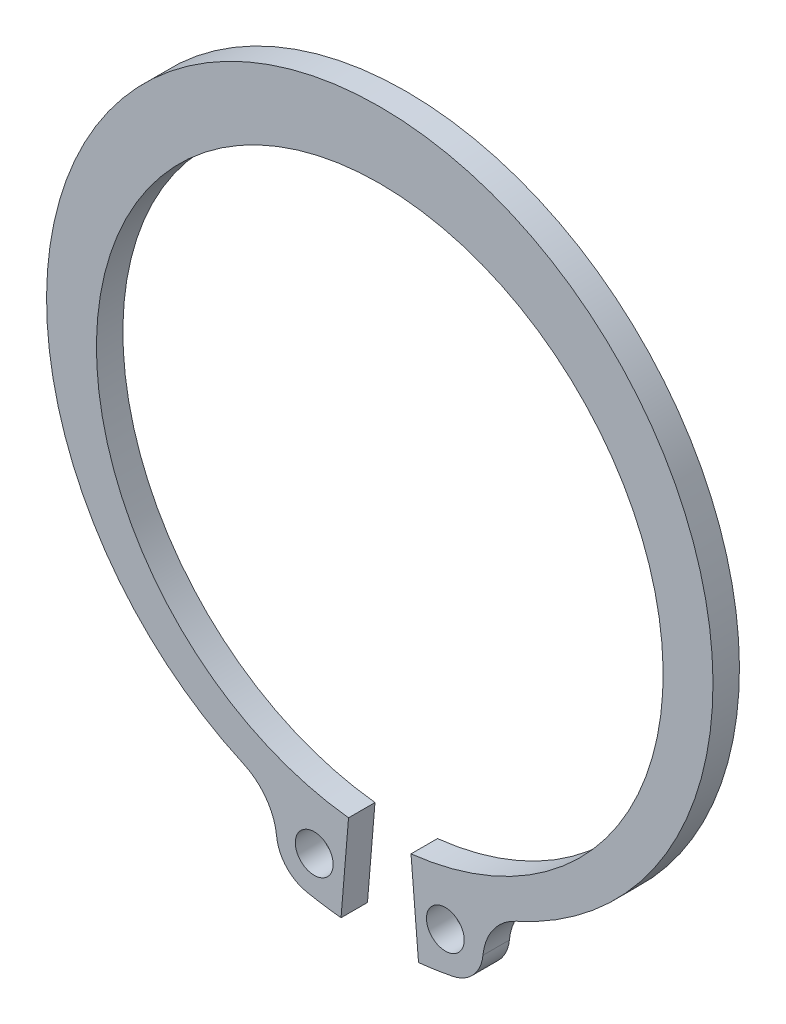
ISO-10303-21;
HEADER;
FILE_DESCRIPTION(('STEP AP214'),'2;1');
FILE_NAME('part.step','',(''),(''),'','','');
FILE_SCHEMA(('AUTOMOTIVE_DESIGN { 1 0 10303 214 1 1 1 1 }'));
ENDSEC;
DATA;
#1=APPLICATION_CONTEXT('core data for automotive mechanical design processes');
#2=APPLICATION_PROTOCOL_DEFINITION('international standard','automotive_design',2000,#1);
#3=PRODUCT_CONTEXT('',#1,'mechanical');
#4=PRODUCT('Part','Part','',(#3));
#5=PRODUCT_RELATED_PRODUCT_CATEGORY('part','',(#4));
#6=PRODUCT_DEFINITION_FORMATION('','',#4);
#7=PRODUCT_DEFINITION_CONTEXT('part definition',#1,'design');
#8=PRODUCT_DEFINITION('design','',#6,#7);
#9=PRODUCT_DEFINITION_SHAPE('','',#8);
#10=(LENGTH_UNIT() NAMED_UNIT(*) SI_UNIT(.MILLI.,.METRE.));
#11=(NAMED_UNIT(*) PLANE_ANGLE_UNIT() SI_UNIT($,.RADIAN.));
#12=(NAMED_UNIT(*) SI_UNIT($,.STERADIAN.) SOLID_ANGLE_UNIT());
#13=UNCERTAINTY_MEASURE_WITH_UNIT(LENGTH_MEASURE(1.E-05),#10,'distance_accuracy_value','');
#14=(GEOMETRIC_REPRESENTATION_CONTEXT(3) GLOBAL_UNCERTAINTY_ASSIGNED_CONTEXT((#13)) GLOBAL_UNIT_ASSIGNED_CONTEXT((#10,
#11,#12)) REPRESENTATION_CONTEXT('',''));
#15=CARTESIAN_POINT('',(0.,0.,0.));
#16=DIRECTION('',(0.,0.,1.));
#17=DIRECTION('',(1.,0.,0.));
#18=AXIS2_PLACEMENT_3D('',#15,#16,#17);
#19=CARTESIAN_POINT('',(1.1666015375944E-13,-2.22044604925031E-13,1.74999999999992));
#20=DIRECTION('',(0.,0.,1.));
#21=DIRECTION('',(1.,0.,0.));
#22=AXIS2_PLACEMENT_3D('',#19,#20,#21);
#23=PLANE('',#22);
#24=CARTESIAN_POINT('',(-4.33870801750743,-21.8211407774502,1.74999999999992));
#25=DIRECTION('',(0.,0.,1.));
#26=DIRECTION('',(-1.,0.,0.));
#27=AXIS2_PLACEMENT_3D('',#24,#25,#26);
#28=CIRCLE('',#27,1.25);
#29=CARTESIAN_POINT('',(-5.58870801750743,-21.8211407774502,1.74999999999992));
#30=VERTEX_POINT('',#29);
#31=EDGE_CURVE('E128',#30,#30,#28,.T.);
#32=ORIENTED_EDGE('',*,*,#31,.F.);
#33=EDGE_LOOP('',(#32));
#34=FACE_BOUND('',#33,.T.);
#35=CARTESIAN_POINT('',(1.1666015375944E-13,-2.22044604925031E-13,1.74999999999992));
#36=DIRECTION('',(0.,0.,-1.));
#37=DIRECTION('',(1.,0.,0.));
#38=AXIS2_PLACEMENT_3D('',#35,#36,#37);
#39=CIRCLE('',#38,18.75);
#40=CARTESIAN_POINT('',(-2.06665131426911,-18.6357573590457,1.74999999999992));
#41=VERTEX_POINT('',#40);
#42=CARTESIAN_POINT('',(2.0666513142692,-18.6357573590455,1.74999999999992));
#43=VERTEX_POINT('',#42);
#44=EDGE_CURVE('E150',#41,#43,#39,.T.);
#45=ORIENTED_EDGE('',*,*,#44,.T.);
#46=DIRECTION('',(0.0829496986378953,-0.996553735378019,0.));
#47=VECTOR('',#46,1.);
#48=CARTESIAN_POINT('',(2.0666513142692,-18.6357573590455,1.74999999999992));
#49=LINE('',#48,#47);
#50=CARTESIAN_POINT('',(2.56434950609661,-24.6150797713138,1.74999999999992));
#51=VERTEX_POINT('',#50);
#52=EDGE_CURVE('E123',#43,#51,#49,.T.);
#53=ORIENTED_EDGE('',*,*,#52,.T.);
#54=CARTESIAN_POINT('',(1.1666015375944E-13,-2.22044604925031E-13,1.74999999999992));
#55=DIRECTION('',(0.,0.,1.));
#56=DIRECTION('',(1.,0.,0.));
#57=AXIS2_PLACEMENT_3D('',#54,#55,#56);
#58=CIRCLE('',#57,24.7482936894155);
#59=CARTESIAN_POINT('',(4.82624068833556,-24.2731423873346,1.75000000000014));
#60=VERTEX_POINT('',#59);
#61=EDGE_CURVE('E153',#51,#60,#58,.T.);
#62=ORIENTED_EDGE('',*,*,#61,.T.);
#63=CARTESIAN_POINT('',(4.3387080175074,-21.8211407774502,1.74999999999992));
#64=DIRECTION('',(0.,0.,1.));
#65=DIRECTION('',(1.,0.,0.));
#66=AXIS2_PLACEMENT_3D('',#63,#64,#65);
#67=CIRCLE('',#66,2.5);
#68=CARTESIAN_POINT('',(6.8263893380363,-22.0690150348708,1.74999999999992));
#69=VERTEX_POINT('',#68);
#70=EDGE_CURVE('E155',#60,#69,#67,.T.);
#71=ORIENTED_EDGE('',*,*,#70,.T.);
#72=CARTESIAN_POINT('',(10.5579113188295,-22.4408264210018,1.74999999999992));
#73=DIRECTION('',(0.,0.,-1.));
#74=DIRECTION('',(1.,0.,0.));
#75=AXIS2_PLACEMENT_3D('',#72,#73,#74);
#76=CIRCLE('',#75,3.75);
#77=CARTESIAN_POINT('',(9.02333118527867,-19.0191946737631,1.74999999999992));
#78=VERTEX_POINT('',#77);
#79=EDGE_CURVE('E157',#69,#78,#76,.T.);
#80=ORIENTED_EDGE('',*,*,#79,.T.);
#81=CARTESIAN_POINT('',(0.,1.09999999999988,1.74999999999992));
#82=DIRECTION('',(0.,0.,1.));
#83=DIRECTION('',(1.,0.,0.));
#84=AXIS2_PLACEMENT_3D('',#81,#82,#83);
#85=CIRCLE('',#84,22.05);
#86=CARTESIAN_POINT('',(-9.02333118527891,-19.019194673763,1.74999999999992));
#87=VERTEX_POINT('',#86);
#88=EDGE_CURVE('E159',#78,#87,#85,.T.);
#89=ORIENTED_EDGE('',*,*,#88,.T.);
#90=CARTESIAN_POINT('',(-10.5579113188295,-22.4408264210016,1.74999999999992));
#91=DIRECTION('',(0.,0.,-1.));
#92=DIRECTION('',(-1.,0.,0.));
#93=AXIS2_PLACEMENT_3D('',#90,#91,#92);
#94=CIRCLE('',#93,3.75);
#95=CARTESIAN_POINT('',(-6.82638933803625,-22.0690150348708,1.74999999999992));
#96=VERTEX_POINT('',#95);
#97=EDGE_CURVE('E161',#87,#96,#94,.T.);
#98=ORIENTED_EDGE('',*,*,#97,.T.);
#99=CARTESIAN_POINT('',(-4.33870801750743,-21.8211407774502,1.74999999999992));
#100=DIRECTION('',(0.,0.,1.));
#101=DIRECTION('',(-1.,0.,0.));
#102=AXIS2_PLACEMENT_3D('',#99,#100,#101);
#103=CIRCLE('',#102,2.5);
#104=CARTESIAN_POINT('',(-4.82624068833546,-24.2731423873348,1.74999999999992));
#105=VERTEX_POINT('',#104);
#106=EDGE_CURVE('E163',#96,#105,#103,.T.);
#107=ORIENTED_EDGE('',*,*,#106,.T.);
#108=CARTESIAN_POINT('',(1.1666015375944E-13,-2.22044604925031E-13,1.74999999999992));
#109=DIRECTION('',(0.,0.,1.));
#110=DIRECTION('',(-1.,0.,0.));
#111=AXIS2_PLACEMENT_3D('',#108,#109,#110);
#112=CIRCLE('',#111,24.7482936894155);
#113=CARTESIAN_POINT('',(-2.56434950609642,-24.6150797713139,1.74999999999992));
#114=VERTEX_POINT('',#113);
#115=EDGE_CURVE('E52',#105,#114,#112,.T.);
#116=ORIENTED_EDGE('',*,*,#115,.T.);
#117=DIRECTION('',(0.0829496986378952,0.996553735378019,0.));
#118=VECTOR('',#117,1.);
#119=CARTESIAN_POINT('',(-2.06665131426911,-18.6357573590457,1.74999999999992));
#120=LINE('',#119,#118);
#121=EDGE_CURVE('E47',#114,#41,#120,.T.);
#122=ORIENTED_EDGE('',*,*,#121,.T.);
#123=EDGE_LOOP('',(#45,#53,#62,#71,#80,#89,#98,#107,#116,#122));
#124=FACE_BOUND('',#123,.T.);
#125=CARTESIAN_POINT('',(4.3387080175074,-21.8211407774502,1.74999999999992));
#126=DIRECTION('',(0.,0.,1.));
#127=DIRECTION('',(1.,0.,0.));
#128=AXIS2_PLACEMENT_3D('',#125,#126,#127);
#129=CIRCLE('',#128,1.25);
#130=CARTESIAN_POINT('',(3.0887080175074,-21.8211407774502,1.74999999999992));
#131=VERTEX_POINT('',#130);
#132=EDGE_CURVE('E250',#131,#131,#129,.T.);
#133=ORIENTED_EDGE('',*,*,#132,.F.);
#134=EDGE_LOOP('',(#133));
#135=FACE_BOUND('',#134,.T.);
#136=ADVANCED_FACE('F32',(#34,#124,#135),#23,.T.);
#137=CARTESIAN_POINT('',(0.,0.,0.));
#138=DIRECTION('',(0.,0.,1.));
#139=DIRECTION('',(1.,0.,0.));
#140=AXIS2_PLACEMENT_3D('',#137,#138,#139);
#141=PLANE('',#140);
#142=CARTESIAN_POINT('',(-4.33870801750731,-21.8211407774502,0.));
#143=DIRECTION('',(0.,0.,1.));
#144=DIRECTION('',(-1.,0.,0.));
#145=AXIS2_PLACEMENT_3D('',#142,#143,#144);
#146=CIRCLE('',#145,1.25);
#147=CARTESIAN_POINT('',(-5.58870801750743,-21.8211407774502,0.));
#148=VERTEX_POINT('',#147);
#149=EDGE_CURVE('E131',#148,#148,#146,.T.);
#150=ORIENTED_EDGE('',*,*,#149,.T.);
#151=EDGE_LOOP('',(#150));
#152=FACE_BOUND('',#151,.T.);
#153=CARTESIAN_POINT('',(0.,0.,0.));
#154=DIRECTION('',(0.,0.,-1.));
#155=DIRECTION('',(1.,0.,0.));
#156=AXIS2_PLACEMENT_3D('',#153,#154,#155);
#157=CIRCLE('',#156,18.75);
#158=CARTESIAN_POINT('',(-2.0666513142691,-18.6357573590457,2.22044604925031E-13));
#159=VERTEX_POINT('',#158);
#160=CARTESIAN_POINT('',(2.06665131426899,-18.6357573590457,4.44089209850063E-13));
#161=VERTEX_POINT('',#160);
#162=EDGE_CURVE('E114',#159,#161,#157,.T.);
#163=ORIENTED_EDGE('',*,*,#162,.F.);
#164=DIRECTION('',(0.0829496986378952,0.996553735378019,0.));
#165=VECTOR('',#164,1.);
#166=CARTESIAN_POINT('',(-2.0666513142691,-18.6357573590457,2.22044604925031E-13));
#167=LINE('',#166,#165);
#168=CARTESIAN_POINT('',(-2.56434950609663,-24.6150797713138,0.));
#169=VERTEX_POINT('',#168);
#170=EDGE_CURVE('E148',#169,#159,#167,.T.);
#171=ORIENTED_EDGE('',*,*,#170,.F.);
#172=CARTESIAN_POINT('',(0.,0.,0.));
#173=DIRECTION('',(0.,0.,1.));
#174=DIRECTION('',(-1.,0.,0.));
#175=AXIS2_PLACEMENT_3D('',#172,#173,#174);
#176=CIRCLE('',#175,24.7482936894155);
#177=CARTESIAN_POINT('',(-4.82624068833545,-24.2731423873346,0.));
#178=VERTEX_POINT('',#177);
#179=EDGE_CURVE('E146',#178,#169,#176,.T.);
#180=ORIENTED_EDGE('',*,*,#179,.F.);
#181=CARTESIAN_POINT('',(-4.33870801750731,-21.8211407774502,0.));
#182=DIRECTION('',(0.,0.,1.));
#183=DIRECTION('',(-1.,0.,0.));
#184=AXIS2_PLACEMENT_3D('',#181,#182,#183);
#185=CIRCLE('',#184,2.5);
#186=CARTESIAN_POINT('',(-6.82638933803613,-22.069015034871,0.));
#187=VERTEX_POINT('',#186);
#188=EDGE_CURVE('E144',#187,#178,#185,.T.);
#189=ORIENTED_EDGE('',*,*,#188,.F.);
#190=CARTESIAN_POINT('',(-10.5579113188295,-22.4408264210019,0.));
#191=DIRECTION('',(0.,0.,-1.));
#192=DIRECTION('',(-1.,0.,0.));
#193=AXIS2_PLACEMENT_3D('',#190,#191,#192);
#194=CIRCLE('',#193,3.75);
#195=CARTESIAN_POINT('',(-9.02333118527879,-19.0191946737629,0.));
#196=VERTEX_POINT('',#195);
#197=EDGE_CURVE('E142',#196,#187,#194,.T.);
#198=ORIENTED_EDGE('',*,*,#197,.F.);
#199=CARTESIAN_POINT('',(0.,1.09999999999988,0.));
#200=DIRECTION('',(0.,0.,1.));
#201=DIRECTION('',(1.,0.,0.));
#202=AXIS2_PLACEMENT_3D('',#199,#200,#201);
#203=CIRCLE('',#202,22.05);
#204=CARTESIAN_POINT('',(9.02333118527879,-19.0191946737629,0.));
#205=VERTEX_POINT('',#204);
#206=EDGE_CURVE('E140',#205,#196,#203,.T.);
#207=ORIENTED_EDGE('',*,*,#206,.F.);
#208=CARTESIAN_POINT('',(10.5579113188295,-22.4408264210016,0.));
#209=DIRECTION('',(0.,0.,-1.));
#210=DIRECTION('',(1.,0.,0.));
#211=AXIS2_PLACEMENT_3D('',#208,#209,#210);
#212=CIRCLE('',#211,3.75);
#213=CARTESIAN_POINT('',(6.82638933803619,-22.0690150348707,2.22044604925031E-13));
#214=VERTEX_POINT('',#213);
#215=EDGE_CURVE('E138',#214,#205,#212,.T.);
#216=ORIENTED_EDGE('',*,*,#215,.F.);
#217=CARTESIAN_POINT('',(4.33870801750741,-21.8211407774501,0.));
#218=DIRECTION('',(0.,0.,1.));
#219=DIRECTION('',(1.,0.,0.));
#220=AXIS2_PLACEMENT_3D('',#217,#218,#219);
#221=CIRCLE('',#220,2.5);
#222=CARTESIAN_POINT('',(4.82624068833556,-24.2731423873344,0.));
#223=VERTEX_POINT('',#222);
#224=EDGE_CURVE('E136',#223,#214,#221,.T.);
#225=ORIENTED_EDGE('',*,*,#224,.F.);
#226=CARTESIAN_POINT('',(0.,0.,0.));
#227=DIRECTION('',(0.,0.,1.));
#228=DIRECTION('',(1.,0.,0.));
#229=AXIS2_PLACEMENT_3D('',#226,#227,#228);
#230=CIRCLE('',#229,24.7482936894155);
#231=CARTESIAN_POINT('',(2.5643495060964,-24.6150797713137,0.));
#232=VERTEX_POINT('',#231);
#233=EDGE_CURVE('E116',#232,#223,#230,.T.);
#234=ORIENTED_EDGE('',*,*,#233,.F.);
#235=DIRECTION('',(0.0829496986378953,-0.996553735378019,0.));
#236=VECTOR('',#235,1.);
#237=CARTESIAN_POINT('',(2.06665131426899,-18.6357573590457,4.44089209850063E-13));
#238=LINE('',#237,#236);
#239=EDGE_CURVE('E109',#161,#232,#238,.T.);
#240=ORIENTED_EDGE('',*,*,#239,.F.);
#241=EDGE_LOOP('',(#163,#171,#180,#189,#198,#207,#216,#225,#234,#240));
#242=FACE_BOUND('',#241,.T.);
#243=CARTESIAN_POINT('',(4.33870801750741,-21.8211407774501,0.));
#244=DIRECTION('',(0.,0.,1.));
#245=DIRECTION('',(1.,0.,0.));
#246=AXIS2_PLACEMENT_3D('',#243,#244,#245);
#247=CIRCLE('',#246,1.25);
#248=CARTESIAN_POINT('',(3.0887080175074,-21.8211407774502,0.));
#249=VERTEX_POINT('',#248);
#250=EDGE_CURVE('E253',#249,#249,#247,.T.);
#251=ORIENTED_EDGE('',*,*,#250,.T.);
#252=EDGE_LOOP('',(#251));
#253=FACE_BOUND('',#252,.T.);
#254=ADVANCED_FACE('F110',(#152,#242,#253),#141,.F.);
#255=CARTESIAN_POINT('',(1.1666015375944E-13,-2.22044604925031E-13,1.74999999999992));
#256=DIRECTION('',(0.,0.,-1.));
#257=DIRECTION('',(-1.,0.,0.));
#258=AXIS2_PLACEMENT_3D('',#255,#256,#257);
#259=CYLINDRICAL_SURFACE('',#258,18.75);
#260=ORIENTED_EDGE('',*,*,#162,.T.);
#261=DIRECTION('',(0.,0.,-1.));
#262=VECTOR('',#261,1.);
#263=CARTESIAN_POINT('',(2.0666513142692,-18.6357573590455,1.74999999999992));
#264=LINE('',#263,#262);
#265=EDGE_CURVE('E11',#43,#161,#264,.T.);
#266=ORIENTED_EDGE('',*,*,#265,.F.);
#267=ORIENTED_EDGE('',*,*,#44,.F.);
#268=DIRECTION('',(0.,0.,-1.));
#269=VECTOR('',#268,1.);
#270=CARTESIAN_POINT('',(-2.06665131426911,-18.6357573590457,1.74999999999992));
#271=LINE('',#270,#269);
#272=EDGE_CURVE('E127',#41,#159,#271,.T.);
#273=ORIENTED_EDGE('',*,*,#272,.T.);
#274=EDGE_LOOP('',(#260,#266,#267,#273));
#275=FACE_BOUND('',#274,.T.);
#276=ADVANCED_FACE('F34',(#275),#259,.F.);
#277=CARTESIAN_POINT('',(2.0666513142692,-18.6357573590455,1.74999999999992));
#278=DIRECTION('',(0.996553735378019,0.0829496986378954,0.));
#279=DIRECTION('',(-0.0829496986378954,0.996553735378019,0.));
#280=AXIS2_PLACEMENT_3D('',#277,#278,#279);
#281=PLANE('',#280);
#282=ORIENTED_EDGE('',*,*,#239,.T.);
#283=DIRECTION('',(0.,0.,-1.));
#284=VECTOR('',#283,1.);
#285=CARTESIAN_POINT('',(2.56434950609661,-24.6150797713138,1.74999999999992));
#286=LINE('',#285,#284);
#287=EDGE_CURVE('E40',#51,#232,#286,.T.);
#288=ORIENTED_EDGE('',*,*,#287,.F.);
#289=ORIENTED_EDGE('',*,*,#52,.F.);
#290=ORIENTED_EDGE('',*,*,#265,.T.);
#291=EDGE_LOOP('',(#282,#288,#289,#290));
#292=FACE_BOUND('',#291,.T.);
#293=ADVANCED_FACE('F122',(#292),#281,.F.);
#294=CARTESIAN_POINT('',(1.1666015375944E-13,-2.22044604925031E-13,1.74999999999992));
#295=DIRECTION('',(0.,0.,-1.));
#296=DIRECTION('',(-1.,0.,0.));
#297=AXIS2_PLACEMENT_3D('',#294,#295,#296);
#298=CYLINDRICAL_SURFACE('',#297,24.7482936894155);
#299=ORIENTED_EDGE('',*,*,#233,.T.);
#300=DIRECTION('',(0.,0.,-1.));
#301=VECTOR('',#300,1.);
#302=CARTESIAN_POINT('',(4.82624068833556,-24.2731423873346,1.75000000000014));
#303=LINE('',#302,#301);
#304=EDGE_CURVE('E186',#60,#223,#303,.T.);
#305=ORIENTED_EDGE('',*,*,#304,.F.);
#306=ORIENTED_EDGE('',*,*,#61,.F.);
#307=ORIENTED_EDGE('',*,*,#287,.T.);
#308=EDGE_LOOP('',(#299,#305,#306,#307));
#309=FACE_BOUND('',#308,.T.);
#310=ADVANCED_FACE('F190',(#309),#298,.T.);
#311=CARTESIAN_POINT('',(4.3387080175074,-21.8211407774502,1.74999999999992));
#312=DIRECTION('',(0.,0.,-1.));
#313=DIRECTION('',(-1.,0.,0.));
#314=AXIS2_PLACEMENT_3D('',#311,#312,#313);
#315=CYLINDRICAL_SURFACE('',#314,2.5);
#316=ORIENTED_EDGE('',*,*,#224,.T.);
#317=DIRECTION('',(0.,0.,-1.));
#318=VECTOR('',#317,1.);
#319=CARTESIAN_POINT('',(6.8263893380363,-22.0690150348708,1.74999999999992));
#320=LINE('',#319,#318);
#321=EDGE_CURVE('E183',#69,#214,#320,.T.);
#322=ORIENTED_EDGE('',*,*,#321,.F.);
#323=ORIENTED_EDGE('',*,*,#70,.F.);
#324=ORIENTED_EDGE('',*,*,#304,.T.);
#325=EDGE_LOOP('',(#316,#322,#323,#324));
#326=FACE_BOUND('',#325,.T.);
#327=ADVANCED_FACE('F198',(#326),#315,.T.);
#328=CARTESIAN_POINT('',(10.5579113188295,-22.4408264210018,1.74999999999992));
#329=DIRECTION('',(0.,0.,-1.));
#330=DIRECTION('',(-1.,0.,0.));
#331=AXIS2_PLACEMENT_3D('',#328,#329,#330);
#332=CYLINDRICAL_SURFACE('',#331,3.75);
#333=ORIENTED_EDGE('',*,*,#215,.T.);
#334=DIRECTION('',(0.,0.,-1.));
#335=VECTOR('',#334,1.);
#336=CARTESIAN_POINT('',(9.02333118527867,-19.0191946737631,1.74999999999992));
#337=LINE('',#336,#335);
#338=EDGE_CURVE('E180',#78,#205,#337,.T.);
#339=ORIENTED_EDGE('',*,*,#338,.F.);
#340=ORIENTED_EDGE('',*,*,#79,.F.);
#341=ORIENTED_EDGE('',*,*,#321,.T.);
#342=EDGE_LOOP('',(#333,#339,#340,#341));
#343=FACE_BOUND('',#342,.T.);
#344=ADVANCED_FACE('F201',(#343),#332,.F.);
#345=CARTESIAN_POINT('',(0.,1.09999999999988,1.74999999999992));
#346=DIRECTION('',(0.,0.,-1.));
#347=DIRECTION('',(-1.,0.,0.));
#348=AXIS2_PLACEMENT_3D('',#345,#346,#347);
#349=CYLINDRICAL_SURFACE('',#348,22.05);
#350=ORIENTED_EDGE('',*,*,#206,.T.);
#351=DIRECTION('',(0.,0.,-1.));
#352=VECTOR('',#351,1.);
#353=CARTESIAN_POINT('',(-9.02333118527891,-19.019194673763,1.74999999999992));
#354=LINE('',#353,#352);
#355=EDGE_CURVE('E177',#87,#196,#354,.T.);
#356=ORIENTED_EDGE('',*,*,#355,.F.);
#357=ORIENTED_EDGE('',*,*,#88,.F.);
#358=ORIENTED_EDGE('',*,*,#338,.T.);
#359=EDGE_LOOP('',(#350,#356,#357,#358));
#360=FACE_BOUND('',#359,.T.);
#361=ADVANCED_FACE('F206',(#360),#349,.T.);
#362=CARTESIAN_POINT('',(-10.5579113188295,-22.4408264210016,1.74999999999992));
#363=DIRECTION('',(0.,0.,-1.));
#364=DIRECTION('',(-1.,0.,0.));
#365=AXIS2_PLACEMENT_3D('',#362,#363,#364);
#366=CYLINDRICAL_SURFACE('',#365,3.75);
#367=ORIENTED_EDGE('',*,*,#197,.T.);
#368=DIRECTION('',(0.,0.,-1.));
#369=VECTOR('',#368,1.);
#370=CARTESIAN_POINT('',(-6.82638933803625,-22.0690150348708,1.74999999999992));
#371=LINE('',#370,#369);
#372=EDGE_CURVE('E174',#96,#187,#371,.T.);
#373=ORIENTED_EDGE('',*,*,#372,.F.);
#374=ORIENTED_EDGE('',*,*,#97,.F.);
#375=ORIENTED_EDGE('',*,*,#355,.T.);
#376=EDGE_LOOP('',(#367,#373,#374,#375));
#377=FACE_BOUND('',#376,.T.);
#378=ADVANCED_FACE('F212',(#377),#366,.F.);
#379=CARTESIAN_POINT('',(-4.33870801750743,-21.8211407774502,1.74999999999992));
#380=DIRECTION('',(0.,0.,-1.));
#381=DIRECTION('',(-1.,0.,0.));
#382=AXIS2_PLACEMENT_3D('',#379,#380,#381);
#383=CYLINDRICAL_SURFACE('',#382,2.5);
#384=ORIENTED_EDGE('',*,*,#188,.T.);
#385=DIRECTION('',(0.,0.,-1.));
#386=VECTOR('',#385,1.);
#387=CARTESIAN_POINT('',(-4.82624068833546,-24.2731423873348,1.74999999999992));
#388=LINE('',#387,#386);
#389=EDGE_CURVE('E171',#105,#178,#388,.T.);
#390=ORIENTED_EDGE('',*,*,#389,.F.);
#391=ORIENTED_EDGE('',*,*,#106,.F.);
#392=ORIENTED_EDGE('',*,*,#372,.T.);
#393=EDGE_LOOP('',(#384,#390,#391,#392));
#394=FACE_BOUND('',#393,.T.);
#395=ADVANCED_FACE('F216',(#394),#383,.T.);
#396=CARTESIAN_POINT('',(1.1666015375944E-13,-2.22044604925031E-13,1.74999999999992));
#397=DIRECTION('',(0.,0.,-1.));
#398=DIRECTION('',(-1.,0.,0.));
#399=AXIS2_PLACEMENT_3D('',#396,#397,#398);
#400=CYLINDRICAL_SURFACE('',#399,24.7482936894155);
#401=ORIENTED_EDGE('',*,*,#179,.T.);
#402=DIRECTION('',(0.,0.,-1.));
#403=VECTOR('',#402,1.);
#404=CARTESIAN_POINT('',(-2.56434950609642,-24.6150797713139,1.74999999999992));
#405=LINE('',#404,#403);
#406=EDGE_CURVE('E168',#114,#169,#405,.T.);
#407=ORIENTED_EDGE('',*,*,#406,.F.);
#408=ORIENTED_EDGE('',*,*,#115,.F.);
#409=ORIENTED_EDGE('',*,*,#389,.T.);
#410=EDGE_LOOP('',(#401,#407,#408,#409));
#411=FACE_BOUND('',#410,.T.);
#412=ADVANCED_FACE('F219',(#411),#400,.T.);
#413=CARTESIAN_POINT('',(-2.06665131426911,-18.6357573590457,1.74999999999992));
#414=DIRECTION('',(-0.996553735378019,0.0829496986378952,0.));
#415=DIRECTION('',(-0.0829496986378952,-0.996553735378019,0.));
#416=AXIS2_PLACEMENT_3D('',#413,#414,#415);
#417=PLANE('',#416);
#418=ORIENTED_EDGE('',*,*,#170,.T.);
#419=ORIENTED_EDGE('',*,*,#272,.F.);
#420=ORIENTED_EDGE('',*,*,#121,.F.);
#421=ORIENTED_EDGE('',*,*,#406,.T.);
#422=EDGE_LOOP('',(#418,#419,#420,#421));
#423=FACE_BOUND('',#422,.T.);
#424=ADVANCED_FACE('F221',(#423),#417,.F.);
#425=CARTESIAN_POINT('',(-4.33870801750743,-21.8211407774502,1.74999999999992));
#426=DIRECTION('',(0.,0.,-1.));
#427=DIRECTION('',(-1.,0.,0.));
#428=AXIS2_PLACEMENT_3D('',#425,#426,#427);
#429=CYLINDRICAL_SURFACE('',#428,1.25);
#430=CARTESIAN_POINT('',(-5.58870801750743,-21.8211407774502,1.74999999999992));
#431=CARTESIAN_POINT('',(-5.58870801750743,-21.8211407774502,1.73177083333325));
#432=CARTESIAN_POINT('',(-5.58870801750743,-21.8211407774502,1.71354166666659));
#433=CARTESIAN_POINT('',(-5.58870801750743,-21.8211407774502,1.67708333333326));
#434=CARTESIAN_POINT('',(-5.58870801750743,-21.8211407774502,1.65885416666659));
#435=CARTESIAN_POINT('',(-5.58870801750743,-21.8211407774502,1.62239583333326));
#436=CARTESIAN_POINT('',(-5.58870801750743,-21.8211407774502,1.60416666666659));
#437=CARTESIAN_POINT('',(-5.58870801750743,-21.8211407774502,1.56770833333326));
#438=CARTESIAN_POINT('',(-5.58870801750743,-21.8211407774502,1.54947916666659));
#439=CARTESIAN_POINT('',(-5.58870801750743,-21.8211407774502,1.51302083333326));
#440=CARTESIAN_POINT('',(-5.58870801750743,-21.8211407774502,1.4947916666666));
#441=CARTESIAN_POINT('',(-5.58870801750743,-21.8211407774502,1.45833333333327));
#442=CARTESIAN_POINT('',(-5.58870801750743,-21.8211407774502,1.4401041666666));
#443=CARTESIAN_POINT('',(-5.58870801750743,-21.8211407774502,1.40364583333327));
#444=CARTESIAN_POINT('',(-5.58870801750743,-21.8211407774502,1.3854166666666));
#445=CARTESIAN_POINT('',(-5.58870801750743,-21.8211407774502,1.34895833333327));
#446=CARTESIAN_POINT('',(-5.58870801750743,-21.8211407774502,1.3307291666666));
#447=CARTESIAN_POINT('',(-5.58870801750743,-21.8211407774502,1.29427083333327));
#448=CARTESIAN_POINT('',(-5.58870801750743,-21.8211407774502,1.27604166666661));
#449=CARTESIAN_POINT('',(-5.58870801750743,-21.8211407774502,1.23958333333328));
#450=CARTESIAN_POINT('',(-5.58870801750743,-21.8211407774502,1.22135416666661));
#451=CARTESIAN_POINT('',(-5.58870801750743,-21.8211407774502,1.18489583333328));
#452=CARTESIAN_POINT('',(-5.58870801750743,-21.8211407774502,1.16666666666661));
#453=CARTESIAN_POINT('',(-5.58870801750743,-21.8211407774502,1.13020833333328));
#454=CARTESIAN_POINT('',(-5.58870801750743,-21.8211407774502,1.11197916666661));
#455=CARTESIAN_POINT('',(-5.58870801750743,-21.8211407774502,1.07552083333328));
#456=CARTESIAN_POINT('',(-5.58870801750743,-21.8211407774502,1.05729166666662));
#457=CARTESIAN_POINT('',(-5.58870801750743,-21.8211407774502,1.02083333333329));
#458=CARTESIAN_POINT('',(-5.58870801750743,-21.8211407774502,1.00260416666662));
#459=CARTESIAN_POINT('',(-5.58870801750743,-21.8211407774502,0.966145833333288));
#460=CARTESIAN_POINT('',(-5.58870801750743,-21.8211407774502,0.947916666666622));
#461=CARTESIAN_POINT('',(-5.58870801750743,-21.8211407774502,0.911458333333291));
#462=CARTESIAN_POINT('',(-5.58870801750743,-21.8211407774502,0.893229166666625));
#463=CARTESIAN_POINT('',(-5.58870801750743,-21.8211407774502,0.856770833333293));
#464=CARTESIAN_POINT('',(-5.58870801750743,-21.8211407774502,0.838541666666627));
#465=CARTESIAN_POINT('',(-5.58870801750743,-21.8211407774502,0.802083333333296));
#466=CARTESIAN_POINT('',(-5.58870801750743,-21.8211407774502,0.78385416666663));
#467=CARTESIAN_POINT('',(-5.58870801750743,-21.8211407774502,0.747395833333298));
#468=CARTESIAN_POINT('',(-5.58870801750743,-21.8211407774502,0.729166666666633));
#469=CARTESIAN_POINT('',(-5.58870801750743,-21.8211407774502,0.692708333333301));
#470=CARTESIAN_POINT('',(-5.58870801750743,-21.8211407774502,0.674479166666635));
#471=CARTESIAN_POINT('',(-5.58870801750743,-21.8211407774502,0.638020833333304));
#472=CARTESIAN_POINT('',(-5.58870801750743,-21.8211407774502,0.619791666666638));
#473=CARTESIAN_POINT('',(-5.58870801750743,-21.8211407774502,0.583333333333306));
#474=CARTESIAN_POINT('',(-5.58870801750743,-21.8211407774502,0.56510416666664));
#475=CARTESIAN_POINT('',(-5.58870801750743,-21.8211407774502,0.528645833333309));
#476=CARTESIAN_POINT('',(-5.58870801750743,-21.8211407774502,0.510416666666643));
#477=CARTESIAN_POINT('',(-5.58870801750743,-21.8211407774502,0.473958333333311));
#478=CARTESIAN_POINT('',(-5.58870801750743,-21.8211407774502,0.455729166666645));
#479=CARTESIAN_POINT('',(-5.58870801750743,-21.8211407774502,0.419270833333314));
#480=CARTESIAN_POINT('',(-5.58870801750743,-21.8211407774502,0.401041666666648));
#481=CARTESIAN_POINT('',(-5.58870801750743,-21.8211407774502,0.364583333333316));
#482=CARTESIAN_POINT('',(-5.58870801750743,-21.8211407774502,0.34635416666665));
#483=CARTESIAN_POINT('',(-5.58870801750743,-21.8211407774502,0.309895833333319));
#484=CARTESIAN_POINT('',(-5.58870801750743,-21.8211407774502,0.291666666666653));
#485=CARTESIAN_POINT('',(-5.58870801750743,-21.8211407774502,0.255208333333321));
#486=CARTESIAN_POINT('',(-5.58870801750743,-21.8211407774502,0.236979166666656));
#487=CARTESIAN_POINT('',(-5.58870801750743,-21.8211407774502,0.200520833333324));
#488=CARTESIAN_POINT('',(-5.58870801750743,-21.8211407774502,0.182291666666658));
#489=CARTESIAN_POINT('',(-5.58870801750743,-21.8211407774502,0.145833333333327));
#490=CARTESIAN_POINT('',(-5.58870801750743,-21.8211407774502,0.127604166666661));
#491=CARTESIAN_POINT('',(-5.58870801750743,-21.8211407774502,0.0911458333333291));
#492=CARTESIAN_POINT('',(-5.58870801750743,-21.8211407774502,0.0729166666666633));
#493=CARTESIAN_POINT('',(-5.58870801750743,-21.8211407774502,0.0364583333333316));
#494=CARTESIAN_POINT('',(-5.58870801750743,-21.8211407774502,0.0182291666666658));
#495=CARTESIAN_POINT('',(-5.58870801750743,-21.8211407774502,0.));
#496=B_SPLINE_CURVE_WITH_KNOTS('',3,(#430,#431,#432,#433,#434,#435,#436,#437,#438,#439,#440,
#441,#442,#443,#444,#445,#446,#447,#448,#449,#450,#451,#452,#453,#454,#455,#456,#457,#458,#459,
#460,#461,#462,#463,#464,#465,#466,#467,#468,#469,#470,#471,#472,#473,#474,#475,#476,#477,#478,
#479,#480,#481,#482,#483,#484,#485,#486,#487,#488,#489,#490,#491,#492,#493,#494,#495),
.UNSPECIFIED.,.F.,.F.,(4,2,2,2,2,2,2,2,2,2,2,2,2,2,2,2,2,2,2,2,2,2,2,2,2,2,2,2,2,2,2,2,4),(0.,
0.0546874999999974,0.109374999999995,0.164062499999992,0.21874999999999,0.273437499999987,
0.328124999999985,0.382812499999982,0.43749999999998,0.492187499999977,0.546874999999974,
0.601562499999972,0.656249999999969,0.710937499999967,0.765624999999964,0.820312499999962,
0.874999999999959,0.929687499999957,0.984374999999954,1.03906249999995,1.09374999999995,
1.14843749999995,1.20312499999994,1.25781249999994,1.31249999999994,1.36718749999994,
1.42187499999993,1.47656249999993,1.53124999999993,1.58593749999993,1.64062499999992,
1.69531249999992,1.74999999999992),.UNSPECIFIED.);
#497=EDGE_CURVE('BSEAM223',#30,#148,#496,.T.);
#498=ORIENTED_EDGE('',*,*,#31,.T.);
#499=ORIENTED_EDGE('',*,*,#149,.F.);
#500=ORIENTED_EDGE('',*,*,#497,.T.);
#501=ORIENTED_EDGE('',*,*,#497,.F.);
#502=EDGE_LOOP('',(#498,#500,#499,#501));
#503=FACE_BOUND('',#502,.T.);
#504=ADVANCED_FACE('F223',(#503),#429,.F.);
#505=CARTESIAN_POINT('',(4.3387080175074,-21.8211407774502,1.74999999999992));
#506=DIRECTION('',(0.,0.,-1.));
#507=DIRECTION('',(-1.,0.,0.));
#508=AXIS2_PLACEMENT_3D('',#505,#506,#507);
#509=CYLINDRICAL_SURFACE('',#508,1.25);
#510=CARTESIAN_POINT('',(3.0887080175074,-21.8211407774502,1.74999999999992));
#511=CARTESIAN_POINT('',(3.0887080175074,-21.8211407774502,1.73177083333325));
#512=CARTESIAN_POINT('',(3.0887080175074,-21.8211407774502,1.71354166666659));
#513=CARTESIAN_POINT('',(3.0887080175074,-21.8211407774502,1.67708333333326));
#514=CARTESIAN_POINT('',(3.0887080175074,-21.8211407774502,1.65885416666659));
#515=CARTESIAN_POINT('',(3.0887080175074,-21.8211407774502,1.62239583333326));
#516=CARTESIAN_POINT('',(3.0887080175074,-21.8211407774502,1.60416666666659));
#517=CARTESIAN_POINT('',(3.0887080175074,-21.8211407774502,1.56770833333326));
#518=CARTESIAN_POINT('',(3.0887080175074,-21.8211407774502,1.54947916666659));
#519=CARTESIAN_POINT('',(3.0887080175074,-21.8211407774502,1.51302083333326));
#520=CARTESIAN_POINT('',(3.0887080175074,-21.8211407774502,1.4947916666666));
#521=CARTESIAN_POINT('',(3.0887080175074,-21.8211407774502,1.45833333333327));
#522=CARTESIAN_POINT('',(3.0887080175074,-21.8211407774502,1.4401041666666));
#523=CARTESIAN_POINT('',(3.0887080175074,-21.8211407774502,1.40364583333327));
#524=CARTESIAN_POINT('',(3.0887080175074,-21.8211407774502,1.3854166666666));
#525=CARTESIAN_POINT('',(3.0887080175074,-21.8211407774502,1.34895833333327));
#526=CARTESIAN_POINT('',(3.0887080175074,-21.8211407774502,1.3307291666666));
#527=CARTESIAN_POINT('',(3.0887080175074,-21.8211407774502,1.29427083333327));
#528=CARTESIAN_POINT('',(3.0887080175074,-21.8211407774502,1.27604166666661));
#529=CARTESIAN_POINT('',(3.0887080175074,-21.8211407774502,1.23958333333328));
#530=CARTESIAN_POINT('',(3.0887080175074,-21.8211407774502,1.22135416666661));
#531=CARTESIAN_POINT('',(3.0887080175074,-21.8211407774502,1.18489583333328));
#532=CARTESIAN_POINT('',(3.0887080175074,-21.8211407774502,1.16666666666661));
#533=CARTESIAN_POINT('',(3.0887080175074,-21.8211407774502,1.13020833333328));
#534=CARTESIAN_POINT('',(3.0887080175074,-21.8211407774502,1.11197916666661));
#535=CARTESIAN_POINT('',(3.0887080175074,-21.8211407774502,1.07552083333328));
#536=CARTESIAN_POINT('',(3.0887080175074,-21.8211407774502,1.05729166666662));
#537=CARTESIAN_POINT('',(3.0887080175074,-21.8211407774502,1.02083333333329));
#538=CARTESIAN_POINT('',(3.0887080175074,-21.8211407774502,1.00260416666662));
#539=CARTESIAN_POINT('',(3.0887080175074,-21.8211407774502,0.966145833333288));
#540=CARTESIAN_POINT('',(3.0887080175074,-21.8211407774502,0.947916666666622));
#541=CARTESIAN_POINT('',(3.0887080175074,-21.8211407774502,0.911458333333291));
#542=CARTESIAN_POINT('',(3.0887080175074,-21.8211407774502,0.893229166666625));
#543=CARTESIAN_POINT('',(3.0887080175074,-21.8211407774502,0.856770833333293));
#544=CARTESIAN_POINT('',(3.0887080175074,-21.8211407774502,0.838541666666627));
#545=CARTESIAN_POINT('',(3.0887080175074,-21.8211407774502,0.802083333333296));
#546=CARTESIAN_POINT('',(3.0887080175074,-21.8211407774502,0.78385416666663));
#547=CARTESIAN_POINT('',(3.0887080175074,-21.8211407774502,0.747395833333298));
#548=CARTESIAN_POINT('',(3.0887080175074,-21.8211407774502,0.729166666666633));
#549=CARTESIAN_POINT('',(3.0887080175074,-21.8211407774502,0.692708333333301));
#550=CARTESIAN_POINT('',(3.0887080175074,-21.8211407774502,0.674479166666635));
#551=CARTESIAN_POINT('',(3.0887080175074,-21.8211407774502,0.638020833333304));
#552=CARTESIAN_POINT('',(3.0887080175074,-21.8211407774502,0.619791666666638));
#553=CARTESIAN_POINT('',(3.0887080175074,-21.8211407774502,0.583333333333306));
#554=CARTESIAN_POINT('',(3.0887080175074,-21.8211407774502,0.56510416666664));
#555=CARTESIAN_POINT('',(3.0887080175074,-21.8211407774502,0.528645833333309));
#556=CARTESIAN_POINT('',(3.0887080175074,-21.8211407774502,0.510416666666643));
#557=CARTESIAN_POINT('',(3.0887080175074,-21.8211407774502,0.473958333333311));
#558=CARTESIAN_POINT('',(3.0887080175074,-21.8211407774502,0.455729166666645));
#559=CARTESIAN_POINT('',(3.0887080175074,-21.8211407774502,0.419270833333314));
#560=CARTESIAN_POINT('',(3.0887080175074,-21.8211407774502,0.401041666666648));
#561=CARTESIAN_POINT('',(3.0887080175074,-21.8211407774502,0.364583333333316));
#562=CARTESIAN_POINT('',(3.0887080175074,-21.8211407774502,0.34635416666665));
#563=CARTESIAN_POINT('',(3.0887080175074,-21.8211407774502,0.309895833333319));
#564=CARTESIAN_POINT('',(3.0887080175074,-21.8211407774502,0.291666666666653));
#565=CARTESIAN_POINT('',(3.0887080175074,-21.8211407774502,0.255208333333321));
#566=CARTESIAN_POINT('',(3.0887080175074,-21.8211407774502,0.236979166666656));
#567=CARTESIAN_POINT('',(3.0887080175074,-21.8211407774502,0.200520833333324));
#568=CARTESIAN_POINT('',(3.0887080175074,-21.8211407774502,0.182291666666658));
#569=CARTESIAN_POINT('',(3.0887080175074,-21.8211407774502,0.145833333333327));
#570=CARTESIAN_POINT('',(3.0887080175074,-21.8211407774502,0.127604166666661));
#571=CARTESIAN_POINT('',(3.0887080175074,-21.8211407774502,0.0911458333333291));
#572=CARTESIAN_POINT('',(3.0887080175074,-21.8211407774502,0.0729166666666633));
#573=CARTESIAN_POINT('',(3.0887080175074,-21.8211407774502,0.0364583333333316));
#574=CARTESIAN_POINT('',(3.0887080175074,-21.8211407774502,0.0182291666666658));
#575=CARTESIAN_POINT('',(3.0887080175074,-21.8211407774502,0.));
#576=B_SPLINE_CURVE_WITH_KNOTS('',3,(#510,#511,#512,#513,#514,#515,#516,#517,#518,#519,#520,
#521,#522,#523,#524,#525,#526,#527,#528,#529,#530,#531,#532,#533,#534,#535,#536,#537,#538,#539,
#540,#541,#542,#543,#544,#545,#546,#547,#548,#549,#550,#551,#552,#553,#554,#555,#556,#557,#558,
#559,#560,#561,#562,#563,#564,#565,#566,#567,#568,#569,#570,#571,#572,#573,#574,#575),
.UNSPECIFIED.,.F.,.F.,(4,2,2,2,2,2,2,2,2,2,2,2,2,2,2,2,2,2,2,2,2,2,2,2,2,2,2,2,2,2,2,2,4),(0.,
0.0546874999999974,0.109374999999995,0.164062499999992,0.21874999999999,0.273437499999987,
0.328124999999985,0.382812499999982,0.43749999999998,0.492187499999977,0.546874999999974,
0.601562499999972,0.656249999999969,0.710937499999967,0.765624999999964,0.820312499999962,
0.874999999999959,0.929687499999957,0.984374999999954,1.03906249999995,1.09374999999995,
1.14843749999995,1.20312499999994,1.25781249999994,1.31249999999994,1.36718749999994,
1.42187499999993,1.47656249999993,1.53124999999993,1.58593749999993,1.64062499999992,
1.69531249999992,1.74999999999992),.UNSPECIFIED.);
#577=EDGE_CURVE('BSEAM229',#131,#249,#576,.T.);
#578=ORIENTED_EDGE('',*,*,#132,.T.);
#579=ORIENTED_EDGE('',*,*,#250,.F.);
#580=ORIENTED_EDGE('',*,*,#577,.T.);
#581=ORIENTED_EDGE('',*,*,#577,.F.);
#582=EDGE_LOOP('',(#578,#580,#579,#581));
#583=FACE_BOUND('',#582,.T.);
#584=ADVANCED_FACE('F229',(#583),#509,.F.);
#585=CLOSED_SHELL('',(#136,#254,#276,#293,#310,#327,#344,#361,#378,#395,#412,#424,#504,#584));
#586=MANIFOLD_SOLID_BREP('B2',#585);
#587=ADVANCED_BREP_SHAPE_REPRESENTATION('',(#18,#586),#14);
#588=SHAPE_DEFINITION_REPRESENTATION(#9,#587);
ENDSEC;
END-ISO-10303-21;
